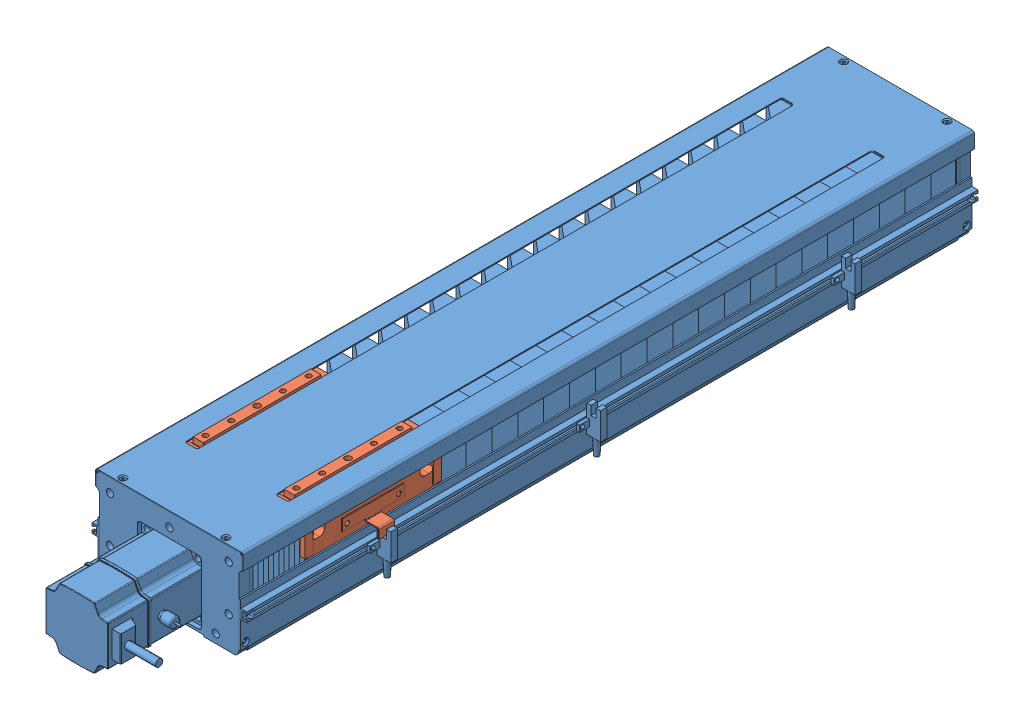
SolidWorks assembly 装配体9.sldasm, configuration 默认 (file format 9000). Lengths in mm.
Overall size (163.4 91 797.5).
2 component instances, 2 part files, 3 mates.
Components (placement in the parent):
- TCD135PS450-风琴罩滑台-1: TCD135PS450-风琴罩滑台.SLDPRT [默认] at (413.491 178.4062 576.6733) size (163.4 89.5 797.5)
- TCD135PS100-滑台-1: TCD135PS100-滑台.SLDPRT [默认] at (413.491 178.4062 751.6733) size (150 75.5 138)
Mates (geometry in assembly coordinates):
- 同心1: concentric anti-aligned: cylinder of TCD135PS450-风琴罩滑台-1 through (413.491 213.9062 883.1733) axis (0 0 1) radius 8; cylinder of TCD135PS100-滑台-1 through (413.491 213.9062 866.6733) axis (0 0 -1) radius 14.25
- LimitDistance1: limit distance = 12 mm anti-aligned: plane of TCD135PS100-滑台-1 through (413.491 209.9062 821.6733) normal (0 0 1); plane of TCD135PS450-风琴罩滑台-1 through (377.991 213.9062 833.6733) normal (0 0 -1)
- 平行1: parallel aligned: plane of TCD135PS450-风琴罩滑台-1 through (413.491 267.9062 576.6733) normal (0 1 0); plane of TCD135PS100-滑台-1 through (313.991 263.9062 744.6733) normal (0 1 0)
